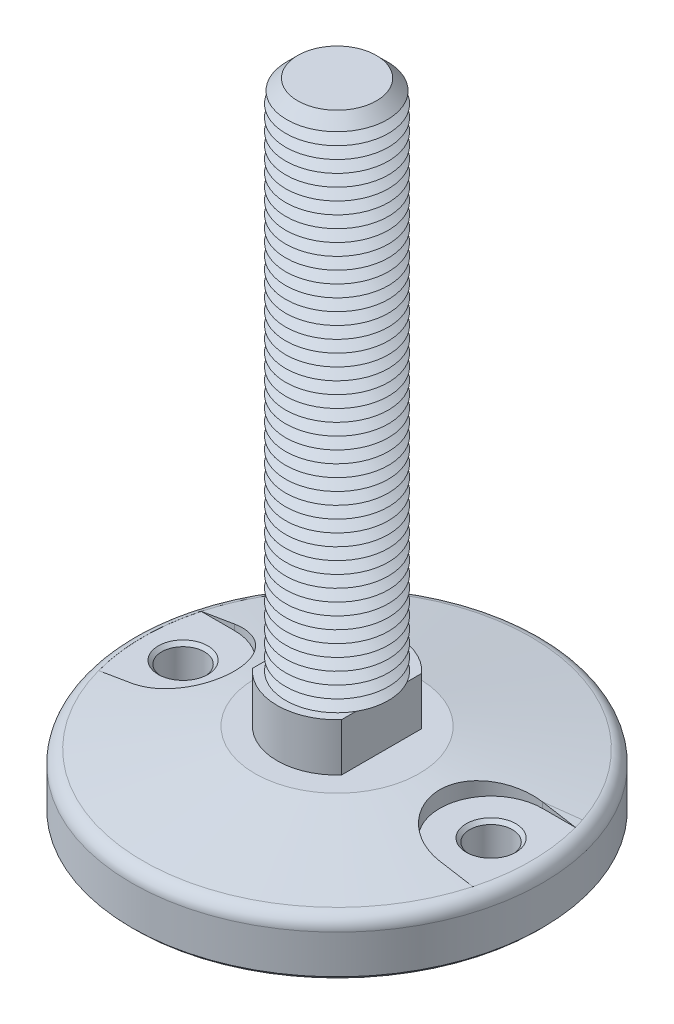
from build123d import *

# Parameters (mm, degrees)
FILLET1_R                = 4
SKETCH3_R                = 17.5
BOSS_EXTRUDE1_DEPTH      = 14
CUT_EXTRUDE1_START       = -14
CUT_EXTRUDE1_DEPTH       = 14
SKETCH5_R                = 15
BOSS_EXTRUDE2_DEPTH      = 150
CHAMFER1_SIZE            = 3.5
LPATTERN1_COUNT          = 42
LPATTERN1_PITCH          = 3.5
CUT_EXTRUDE4_DEPTH       = 5.79
SKETCH10_R               = 6.25
CUT_EXTRUDE5_DEPTH       = 16.21
CHAMFER2_SIZE            = 1
CHAMFER2_OF_MIRROR1_SIZE = 1
CHAMFER3_SIZE            = 1


with BuildPart() as part:
    # Sketch2 → Revolve1 (revolve)
    with BuildSketch(Plane(origin=(0, 0, 0), x_dir=(0, 0, -1), z_dir=(1, 0, 0))):
        Polygon((0, 0), (-24, 0), (-60, -6.347771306), (-60, -22), (0, -22), align=None)
    revolve(axis=Axis((0, 61.338865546, 0), (0, -1, 0)))

    # Fillet1
    fillet1_edges = [part.edges().sort_by_distance(p)[0] for p in [
        (0, -6.347771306, -60),
    ]]
    fillet(fillet1_edges, radius=FILLET1_R)

    # Sketch3 → Boss-Extrude1 (add)
    with BuildSketch(Plane(origin=(0, 0, 0), x_dir=(1, 0, 0), z_dir=(0, 1, 0))):
        with Locations(Location((0, 0, 0), (0, 0, 270))):
            Circle(SKETCH3_R)
    extrude(amount=BOSS_EXTRUDE1_DEPTH)

    # Sketch4 → Cut-Extrude1 (cut)
    with BuildSketch(Plane(origin=(0, 14, 0), x_dir=(1, 0, 0), z_dir=(0, 1, 0)).offset(CUT_EXTRUDE1_START)):
        with BuildLine():
            Line((-13, 11.715374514), (-13, -11.715374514))
            ThreePointArc((-13, -11.715374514), (-17.5, 0), (-13, 11.715374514))
        make_face()
        with BuildLine():
            Line((13, -11.715374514), (13, 11.715374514))
            ThreePointArc((13, 11.715374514), (17.5, 0), (13, -11.715374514))
        make_face()
    extrude(amount=CUT_EXTRUDE1_DEPTH, mode=Mode.SUBTRACT)

    # Sketch5 → Boss-Extrude2 (add)
    with BuildSketch(Plane(origin=(0, 14, 0), x_dir=(1, 0, 0), z_dir=(0, 1, 0))):
        with Locations(Location((0, 0, 0), (0, 0, 29.926434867))):
            Circle(SKETCH5_R)
    extrude(amount=BOSS_EXTRUDE2_DEPTH)

    # Chamfer1
    chamfer1_edges = [part.edges().sort_by_distance(p)[0] for p in [
        (-13, 164, 7.483314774),
    ]]
    chamfer(chamfer1_edges, length=CHAMFER1_SIZE)

    # Sketch6 → Cut-Revolve1 (revolve, cut)
    with BuildSketch(Plane(origin=(0, 0, 0), x_dir=(0, 0, -1), z_dir=(1, 0, 0))):
        Polygon((-15, 14), (-11.968911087, 15.75), (-15, 17.5), align=None)
    cut_revolve1 = revolve(axis=Axis((0, 61.338865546, 0), (0, -1, 0)), mode=Mode.SUBTRACT)

    # LPattern1: Cut-Revolve1 ×42
    with Locations(*[(0, i * LPATTERN1_PITCH, 0) for i in range(1, LPATTERN1_COUNT)]):
        add(cut_revolve1, mode=Mode.SUBTRACT)

    # Sketch8 → Cut-Extrude4 (cut)
    with BuildSketch(Plane(origin=(0, 0, 0), x_dir=(1, 0, 0), z_dir=(0, 1, 0))):
        with BuildLine():
            Line((-45, 15), (-54.674279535, 15))
            ThreePointArc((-54.674279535, 15), (-56.694592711, 0), (-54.674279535, -15))
            Line((-54.674279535, -15), (-45, -15))
            ThreePointArc((-45, -15), (-30, 0), (-45, 15))
        make_face()
    cut_extrude4 = extrude(amount=-CUT_EXTRUDE4_DEPTH, mode=Mode.SUBTRACT)

    # Sketch10 → Cut-Extrude5 (cut)
    with BuildSketch(Plane(origin=(0, -5.79, 0), x_dir=(1, 0, 0), z_dir=(0, 1, 0))):
        with Locations(Location((-45, 0, 0), (0, 0, 270))):
            Circle(SKETCH10_R)
    cut_extrude5 = extrude(amount=-CUT_EXTRUDE5_DEPTH, mode=Mode.SUBTRACT)

    # Chamfer2
    chamfer2_edges = [part.edges().sort_by_distance(p)[0] for p in [
        (-45, -5.79, -6.25),
        (-45, -22, -6.25),
    ]]
    chamfer(chamfer2_edges, length=CHAMFER2_SIZE)

    # Mirror1: Cut-Extrude4, Cut-Extrude5 across plane
    add(cut_extrude4.mirror(Plane(origin=(0, 0, 0), x_dir=(0, 0, 1), z_dir=(1, 0, 0))), mode=Mode.SUBTRACT)
    add(cut_extrude5.mirror(Plane(origin=(0, 0, 0), x_dir=(0, 0, 1), z_dir=(1, 0, 0))), mode=Mode.SUBTRACT)

    # Chamfer2 of Mirror1
    chamfer2_of_mirror1_edges = [part.edges().sort_by_distance(p)[0] for p in [
        (45, -5.79, -6.25),
        (45, -22, -6.25),
    ]]
    chamfer(chamfer2_of_mirror1_edges, length=CHAMFER2_OF_MIRROR1_SIZE)

    # Chamfer3
    chamfer3_edges = [part.edges().sort_by_distance(p)[0] for p in [
        (0, -22, -60),
    ]]
    chamfer(chamfer3_edges, length=CHAMFER3_SIZE)


solid = part.part
